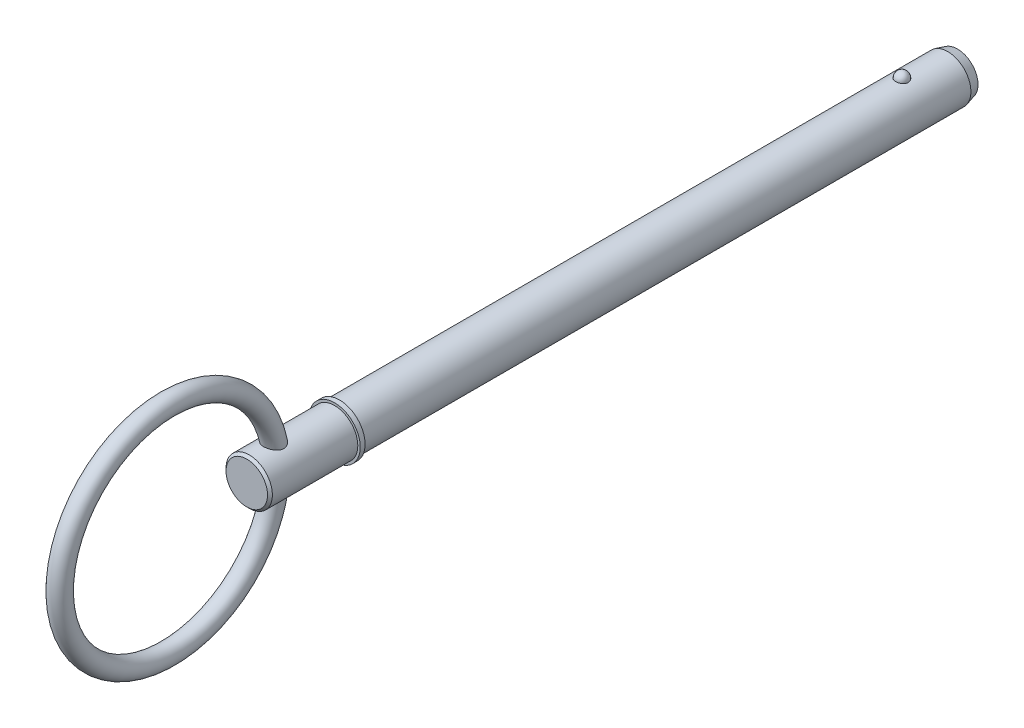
ISO-10303-21;
HEADER;
FILE_DESCRIPTION(('STEP AP214'),'2;1');
FILE_NAME('part.step','',(''),(''),'','','');
FILE_SCHEMA(('AUTOMOTIVE_DESIGN { 1 0 10303 214 1 1 1 1 }'));
ENDSEC;
DATA;
#1=APPLICATION_CONTEXT('core data for automotive mechanical design processes');
#2=APPLICATION_PROTOCOL_DEFINITION('international standard','automotive_design',2000,#1);
#3=PRODUCT_CONTEXT('',#1,'mechanical');
#4=PRODUCT('Part','Part','',(#3));
#5=PRODUCT_RELATED_PRODUCT_CATEGORY('part','',(#4));
#6=PRODUCT_DEFINITION_FORMATION('','',#4);
#7=PRODUCT_DEFINITION_CONTEXT('part definition',#1,'design');
#8=PRODUCT_DEFINITION('design','',#6,#7);
#9=PRODUCT_DEFINITION_SHAPE('','',#8);
#10=(LENGTH_UNIT() NAMED_UNIT(*) SI_UNIT(.MILLI.,.METRE.));
#11=(NAMED_UNIT(*) PLANE_ANGLE_UNIT() SI_UNIT($,.RADIAN.));
#12=(NAMED_UNIT(*) SI_UNIT($,.STERADIAN.) SOLID_ANGLE_UNIT());
#13=UNCERTAINTY_MEASURE_WITH_UNIT(LENGTH_MEASURE(1.E-05),#10,'distance_accuracy_value','');
#14=(GEOMETRIC_REPRESENTATION_CONTEXT(3) GLOBAL_UNCERTAINTY_ASSIGNED_CONTEXT((#13)) GLOBAL_UNIT_ASSIGNED_CONTEXT((#10,
#11,#12)) REPRESENTATION_CONTEXT('',''));
#15=CARTESIAN_POINT('',(0.,0.,0.));
#16=DIRECTION('',(0.,0.,1.));
#17=DIRECTION('',(1.,0.,0.));
#18=AXIS2_PLACEMENT_3D('',#15,#16,#17);
#19=CARTESIAN_POINT('',(0.,0.,114.3));
#20=DIRECTION('',(0.,0.,-1.));
#21=DIRECTION('',(-1.,0.,0.));
#22=AXIS2_PLACEMENT_3D('',#19,#20,#21);
#23=CYLINDRICAL_SURFACE('',#22,4.765);
#24=CARTESIAN_POINT('',(1.27812710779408,4.59038300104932,-1.29000000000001));
#25=CARTESIAN_POINT('',(1.27812572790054,4.59038414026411,-1.2178688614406));
#26=CARTESIAN_POINT('',(1.27223018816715,4.59203736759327,-1.14572000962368));
#27=CARTESIAN_POINT('',(1.24878929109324,4.59846646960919,-1.00346315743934));
#28=CARTESIAN_POINT('',(1.23123896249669,4.60324367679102,-0.933356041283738));
#29=CARTESIAN_POINT('',(1.18493861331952,4.61537801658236,-0.797215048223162));
#30=CARTESIAN_POINT('',(1.15619354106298,4.62273400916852,-0.731179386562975));
#31=CARTESIAN_POINT('',(1.08822596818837,4.6392032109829,-0.604986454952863));
#32=CARTESIAN_POINT('',(1.04900384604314,4.64831635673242,-0.54482897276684));
#33=CARTESIAN_POINT('',(0.960865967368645,4.66733302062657,-0.43177548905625));
#34=CARTESIAN_POINT('',(0.911906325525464,4.67723999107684,-0.378914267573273));
#35=CARTESIAN_POINT('',(0.805678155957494,4.69670280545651,-0.282245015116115));
#36=CARTESIAN_POINT('',(0.748409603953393,4.70625864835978,-0.238437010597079));
#37=CARTESIAN_POINT('',(0.627266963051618,4.72392767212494,-0.161207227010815));
#38=CARTESIAN_POINT('',(0.563411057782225,4.73204466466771,-0.127757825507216));
#39=CARTESIAN_POINT('',(0.430755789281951,4.74595788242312,-0.0720471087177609));
#40=CARTESIAN_POINT('',(0.361956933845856,4.75175434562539,-0.0497846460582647));
#41=CARTESIAN_POINT('',(0.222605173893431,4.76030056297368,-0.0173750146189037));
#42=CARTESIAN_POINT('',(0.152101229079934,4.76309991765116,-0.00703038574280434));
#43=CARTESIAN_POINT('',(0.0103009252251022,4.76551622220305,0.00191361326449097));
#44=CARTESIAN_POINT('',(-0.060995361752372,4.76513345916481,0.000514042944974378));
#45=CARTESIAN_POINT('',(-0.201348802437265,4.76125496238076,-0.0138891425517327));
#46=CARTESIAN_POINT('',(-0.270423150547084,4.75780093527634,-0.026737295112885));
#47=CARTESIAN_POINT('',(-0.405377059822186,4.74820737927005,-0.0634598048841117));
#48=CARTESIAN_POINT('',(-0.4712565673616,4.74206780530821,-0.087334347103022));
#49=CARTESIAN_POINT('',(-0.598375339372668,4.72771507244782,-0.145611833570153));
#50=CARTESIAN_POINT('',(-0.659587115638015,4.71949070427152,-0.180071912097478));
#51=CARTESIAN_POINT('',(-0.775356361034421,4.70185936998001,-0.258542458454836));
#52=CARTESIAN_POINT('',(-0.829913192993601,4.69245229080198,-0.302553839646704));
#53=CARTESIAN_POINT('',(-0.931895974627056,4.67327936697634,-0.399829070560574));
#54=CARTESIAN_POINT('',(-0.979176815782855,4.66351011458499,-0.453244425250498));
#55=CARTESIAN_POINT('',(-1.06421220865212,4.64484426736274,-0.567321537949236));
#56=CARTESIAN_POINT('',(-1.10196613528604,4.63594772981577,-0.627983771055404));
#57=CARTESIAN_POINT('',(-1.16735225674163,4.61992036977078,-0.755585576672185));
#58=CARTESIAN_POINT('',(-1.19487251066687,4.61280933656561,-0.822585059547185));
#59=CARTESIAN_POINT('',(-1.23851975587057,4.60128324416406,-0.960417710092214));
#60=CARTESIAN_POINT('',(-1.25464705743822,4.59686811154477,-1.03125077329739));
#61=CARTESIAN_POINT('',(-1.27505790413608,4.59124882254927,-1.17443804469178));
#62=CARTESIAN_POINT('',(-1.27938868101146,4.59003186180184,-1.24678501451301));
#63=CARTESIAN_POINT('',(-1.27623192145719,4.5909105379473,-1.3911989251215));
#64=CARTESIAN_POINT('',(-1.26874468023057,4.59300609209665,-1.46326587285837));
#65=CARTESIAN_POINT('',(-1.24220427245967,4.60025423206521,-1.60473192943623));
#66=CARTESIAN_POINT('',(-1.2232043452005,4.60539274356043,-1.67414176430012));
#67=CARTESIAN_POINT('',(-1.1741591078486,4.61813957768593,-1.80870154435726));
#68=CARTESIAN_POINT('',(-1.1441133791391,4.62574799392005,-1.87385132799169));
#69=CARTESIAN_POINT('',(-1.07354327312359,4.64263368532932,-1.99841604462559));
#70=CARTESIAN_POINT('',(-1.03296580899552,4.65191934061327,-2.0577997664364));
#71=CARTESIAN_POINT('',(-0.942433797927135,4.67110036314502,-2.16881966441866));
#72=CARTESIAN_POINT('',(-0.892478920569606,4.68099575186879,-2.22045556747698));
#73=CARTESIAN_POINT('',(-0.784302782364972,4.70033161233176,-2.31471696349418));
#74=CARTESIAN_POINT('',(-0.726054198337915,4.70977043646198,-2.35731146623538));
#75=CARTESIAN_POINT('',(-0.602997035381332,4.72709995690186,-2.43206620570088));
#76=CARTESIAN_POINT('',(-0.538188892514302,4.73499075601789,-2.46422713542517));
#77=CARTESIAN_POINT('',(-0.404639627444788,4.7482563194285,-2.51687454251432));
#78=CARTESIAN_POINT('',(-0.33595386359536,4.7536596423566,-2.53749415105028));
#79=CARTESIAN_POINT('',(-0.195948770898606,4.76148510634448,-2.56703727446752));
#80=CARTESIAN_POINT('',(-0.124629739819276,4.76390758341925,-2.57596210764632));
#81=CARTESIAN_POINT('',(0.017269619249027,4.76548774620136,-2.58180339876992));
#82=CARTESIAN_POINT('',(0.0878407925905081,4.76470225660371,-2.57892886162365));
#83=CARTESIAN_POINT('',(0.227467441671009,4.76008019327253,-2.56172603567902));
#84=CARTESIAN_POINT('',(0.296522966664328,4.75624371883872,-2.54739811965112));
#85=CARTESIAN_POINT('',(0.430942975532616,4.74595041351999,-2.50776251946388));
#86=CARTESIAN_POINT('',(0.496319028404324,4.7395023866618,-2.48249170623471));
#87=CARTESIAN_POINT('',(0.621860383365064,4.72467083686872,-2.42167301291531));
#88=CARTESIAN_POINT('',(0.682025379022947,4.71628720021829,-2.38612452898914));
#89=CARTESIAN_POINT('',(0.796409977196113,4.69833598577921,-2.30511163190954));
#90=CARTESIAN_POINT('',(0.850529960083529,4.68875291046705,-2.25951003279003));
#91=CARTESIAN_POINT('',(0.95041297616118,4.66953243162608,-2.15992428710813));
#92=CARTESIAN_POINT('',(0.996174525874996,4.65989501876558,-2.10593865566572));
#93=CARTESIAN_POINT('',(1.07885962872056,4.64145616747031,-1.99009376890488));
#94=CARTESIAN_POINT('',(1.11562789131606,4.63267081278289,-1.92812106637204));
#95=CARTESIAN_POINT('',(1.17840570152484,4.61710269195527,-1.79873681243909));
#96=CARTESIAN_POINT('',(1.20441973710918,4.61031909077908,-1.73132754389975));
#97=CARTESIAN_POINT('',(1.24242116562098,4.60021170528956,-1.60192906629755));
#98=CARTESIAN_POINT('',(1.25578772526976,4.59655387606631,-1.54036674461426));
#99=CARTESIAN_POINT('',(1.27364121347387,4.59163904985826,-1.41587409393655));
#100=CARTESIAN_POINT('',(1.2781283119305,4.59038200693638,-1.35294379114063));
#101=CARTESIAN_POINT('',(1.27812710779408,4.59038300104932,-1.29000000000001));
#102=B_SPLINE_CURVE_WITH_KNOTS('',3,(#24,#25,#26,#27,#28,#29,#30,#31,#32,#33,#34,#35,#36,#37,
#38,#39,#40,#41,#42,#43,#44,#45,#46,#47,#48,#49,#50,#51,#52,#53,#54,#55,#56,#57,#58,#59,#60,#61,
#62,#63,#64,#65,#66,#67,#68,#69,#70,#71,#72,#73,#74,#75,#76,#77,#78,#79,#80,#81,#82,#83,#84,#85,
#86,#87,#88,#89,#90,#91,#92,#93,#94,#95,#96,#97,#98,#99,#100,#101),.UNSPECIFIED.,.T.,.F.,(4,2,2,
2,2,2,2,2,2,2,2,2,2,2,2,2,2,2,2,2,2,2,2,2,2,2,2,2,2,2,2,2,2,2,2,2,2,2,4),(0.,0.216167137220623,
0.432426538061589,0.648590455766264,0.864746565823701,1.0818998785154,1.29905382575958,
1.51562361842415,1.73217119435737,1.94507683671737,2.15796327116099,2.36800220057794,
2.57804465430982,2.78924132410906,3.00045819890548,3.21545551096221,3.43046692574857,
3.64776550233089,3.86505816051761,4.08147951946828,4.29789547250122,4.51331818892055,
4.72874907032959,4.94528769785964,5.1618339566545,5.37911087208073,5.59637335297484,
5.8110751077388,6.02575265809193,6.23664413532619,6.44752874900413,6.65770827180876,
6.86790014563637,7.08116060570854,7.29445887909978,7.51121476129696,7.72788009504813,
7.91651762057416,8.10515153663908),.UNSPECIFIED.);
#103=CARTESIAN_POINT('',(1.27812710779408,4.59038300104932,-1.29000000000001));
#104=VERTEX_POINT('',#103);
#105=EDGE_CURVE('E102',#104,#104,#102,.T.);
#106=ORIENTED_EDGE('',*,*,#105,.T.);
#107=EDGE_LOOP('',(#106));
#108=FACE_BOUND('',#107,.T.);
#109=CARTESIAN_POINT('',(0.,0.,-10.7));
#110=DIRECTION('',(0.,0.,-1.));
#111=DIRECTION('',(-1.,0.,0.));
#112=AXIS2_PLACEMENT_3D('',#109,#110,#111);
#113=CIRCLE('',#112,4.765);
#114=CARTESIAN_POINT('',(-4.765,0.,-10.7));
#115=VERTEX_POINT('',#114);
#116=EDGE_CURVE('E110',#115,#115,#113,.F.);
#117=ORIENTED_EDGE('',*,*,#116,.T.);
#118=EDGE_LOOP('',(#117));
#119=FACE_BOUND('',#118,.T.);
#120=CARTESIAN_POINT('',(0.,0.,114.3));
#121=DIRECTION('',(0.,0.,1.));
#122=DIRECTION('',(1.,0.,0.));
#123=AXIS2_PLACEMENT_3D('',#120,#121,#122);
#124=CIRCLE('',#123,4.765);
#125=CARTESIAN_POINT('',(4.765,0.,114.3));
#126=VERTEX_POINT('',#125);
#127=EDGE_CURVE('E108',#126,#126,#124,.T.);
#128=ORIENTED_EDGE('',*,*,#127,.F.);
#129=EDGE_LOOP('',(#128));
#130=FACE_BOUND('',#129,.T.);
#131=ADVANCED_FACE('F39',(#108,#119,#130),#23,.T.);
#132=CARTESIAN_POINT('',(0.,0.,-12.7));
#133=DIRECTION('',(0.,0.,-1.));
#134=DIRECTION('',(-1.,0.,0.));
#135=AXIS2_PLACEMENT_3D('',#132,#133,#134);
#136=PLANE('',#135);
#137=CARTESIAN_POINT('',(0.,0.,-12.7));
#138=DIRECTION('',(0.,0.,-1.));
#139=DIRECTION('',(-1.,0.,0.));
#140=AXIS2_PLACEMENT_3D('',#137,#138,#139);
#141=CIRCLE('',#140,4.22910161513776);
#142=CARTESIAN_POINT('',(-4.22910161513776,0.,-12.7));
#143=VERTEX_POINT('',#142);
#144=EDGE_CURVE('E141',#143,#143,#141,.T.);
#145=ORIENTED_EDGE('',*,*,#144,.T.);
#146=EDGE_LOOP('',(#145));
#147=FACE_BOUND('',#146,.T.);
#148=ADVANCED_FACE('F88',(#147),#136,.T.);
#149=CARTESIAN_POINT('',(0.,0.,-12.7));
#150=DIRECTION('',(0.,0.,1.));
#151=DIRECTION('',(1.,0.,0.));
#152=AXIS2_PLACEMENT_3D('',#149,#150,#151);
#153=CONICAL_SURFACE('',#152,4.22910161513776,0.261799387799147);
#154=ORIENTED_EDGE('',*,*,#116,.F.);
#155=EDGE_LOOP('',(#154));
#156=FACE_BOUND('',#155,.T.);
#157=ORIENTED_EDGE('',*,*,#144,.F.);
#158=EDGE_LOOP('',(#157));
#159=FACE_BOUND('',#158,.T.);
#160=ADVANCED_FACE('F94',(#156,#159),#153,.T.);
#161=CARTESIAN_POINT('',(0.,4.765,-1.29000000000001));
#162=DIRECTION('',(0.,1.,0.));
#163=DIRECTION('',(0.,0.,-1.));
#164=AXIS2_PLACEMENT_3D('',#161,#162,#163);
#165=SPHERICAL_SURFACE('',#164,1.29);
#166=ORIENTED_EDGE('',*,*,#105,.F.);
#167=EDGE_LOOP('',(#166));
#168=FACE_BOUND('',#167,.T.);
#169=ADVANCED_FACE('F113',(#168),#165,.T.);
#170=CARTESIAN_POINT('',(0.,0.,114.3));
#171=DIRECTION('',(0.,0.,-1.));
#172=DIRECTION('',(-1.,0.,0.));
#173=AXIS2_PLACEMENT_3D('',#170,#171,#172);
#174=PLANE('',#173);
#175=ORIENTED_EDGE('',*,*,#127,.T.);
#176=EDGE_LOOP('',(#175));
#177=FACE_BOUND('',#176,.T.);
#178=CARTESIAN_POINT('',(0.,0.,114.3));
#179=DIRECTION('',(0.,0.,-1.));
#180=DIRECTION('',(-1.,0.,0.));
#181=AXIS2_PLACEMENT_3D('',#178,#179,#180);
#182=CIRCLE('',#181,5.265);
#183=CARTESIAN_POINT('',(-5.265,0.,114.3));
#184=VERTEX_POINT('',#183);
#185=EDGE_CURVE('E109',#184,#184,#182,.T.);
#186=ORIENTED_EDGE('',*,*,#185,.T.);
#187=EDGE_LOOP('',(#186));
#188=FACE_BOUND('',#187,.T.);
#189=ADVANCED_FACE('F117',(#177,#188),#174,.T.);
#190=CARTESIAN_POINT('',(0.,0.,33.7287874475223));
#191=DIRECTION('',(0.,0.,-1.));
#192=DIRECTION('',(-1.,0.,0.));
#193=AXIS2_PLACEMENT_3D('',#190,#191,#192);
#194=CYLINDRICAL_SURFACE('',#193,5.265);
#195=CARTESIAN_POINT('',(0.,0.,115.3));
#196=DIRECTION('',(0.,0.,-1.));
#197=DIRECTION('',(-1.,0.,0.));
#198=AXIS2_PLACEMENT_3D('',#195,#196,#197);
#199=CIRCLE('',#198,5.265);
#200=CARTESIAN_POINT('',(-5.265,0.,115.3));
#201=VERTEX_POINT('',#200);
#202=EDGE_CURVE('E134',#201,#201,#199,.T.);
#203=ORIENTED_EDGE('',*,*,#202,.T.);
#204=EDGE_LOOP('',(#203));
#205=FACE_BOUND('',#204,.T.);
#206=ORIENTED_EDGE('',*,*,#185,.F.);
#207=EDGE_LOOP('',(#206));
#208=FACE_BOUND('',#207,.T.);
#209=ADVANCED_FACE('F121',(#205,#208),#194,.T.);
#210=CARTESIAN_POINT('',(0.,5.265,115.3));
#211=DIRECTION('',(0.,0.,1.));
#212=DIRECTION('',(1.,0.,0.));
#213=AXIS2_PLACEMENT_3D('',#210,#211,#212);
#214=PLANE('',#213);
#215=CARTESIAN_POINT('',(0.,0.,115.3));
#216=DIRECTION('',(0.,0.,1.));
#217=DIRECTION('',(1.,0.,0.));
#218=AXIS2_PLACEMENT_3D('',#215,#216,#217);
#219=CIRCLE('',#218,4.765);
#220=CARTESIAN_POINT('',(4.765,0.,115.3));
#221=VERTEX_POINT('',#220);
#222=EDGE_CURVE('E112',#221,#221,#219,.T.);
#223=ORIENTED_EDGE('',*,*,#222,.F.);
#224=EDGE_LOOP('',(#223));
#225=FACE_BOUND('',#224,.T.);
#226=ORIENTED_EDGE('',*,*,#202,.F.);
#227=EDGE_LOOP('',(#226));
#228=FACE_BOUND('',#227,.T.);
#229=ADVANCED_FACE('F85',(#225,#228),#214,.T.);
#230=CARTESIAN_POINT('',(0.,0.,133.35));
#231=DIRECTION('',(0.,0.,-1.));
#232=DIRECTION('',(-1.,0.,0.));
#233=AXIS2_PLACEMENT_3D('',#230,#231,#232);
#234=CYLINDRICAL_SURFACE('',#233,4.765);
#235=CARTESIAN_POINT('',(-1.1760358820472,-4.61759294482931,126.18372006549));
#236=CARTESIAN_POINT('',(-1.08605054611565,-4.64050753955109,126.1215688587));
#237=CARTESIAN_POINT('',(-0.990486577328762,-4.66202408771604,126.06673933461));
#238=CARTESIAN_POINT('',(-0.790762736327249,-4.70002969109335,125.972995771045));
#239=CARTESIAN_POINT('',(-0.686587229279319,-4.7165093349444,125.934111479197));
#240=CARTESIAN_POINT('',(-0.472539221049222,-4.74273618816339,125.873267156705));
#241=CARTESIAN_POINT('',(-0.362665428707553,-4.75248186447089,125.851310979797));
#242=CARTESIAN_POINT('',(-0.140482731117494,-4.7642267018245,125.824936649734));
#243=CARTESIAN_POINT('',(-0.0281752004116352,-4.7662301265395,125.820508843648));
#244=CARTESIAN_POINT('',(0.193745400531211,-4.76233166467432,125.829208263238));
#245=CARTESIAN_POINT('',(0.303372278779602,-4.75656024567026,125.842045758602));
#246=CARTESIAN_POINT('',(0.518724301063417,-4.73791484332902,125.884434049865));
#247=CARTESIAN_POINT('',(0.624448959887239,-4.72503997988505,125.913986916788));
#248=CARTESIAN_POINT('',(0.829434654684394,-4.69340588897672,125.98920858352));
#249=CARTESIAN_POINT('',(0.928674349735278,-4.67462830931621,126.034927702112));
#250=CARTESIAN_POINT('',(1.11777413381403,-4.63305392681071,126.141473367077));
#251=CARTESIAN_POINT('',(1.2076321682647,-4.61025624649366,126.202303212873));
#252=CARTESIAN_POINT('',(1.37762760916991,-4.56238439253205,126.339439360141));
#253=CARTESIAN_POINT('',(1.45749020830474,-4.53726959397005,126.41607281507));
#254=CARTESIAN_POINT('',(1.60275140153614,-4.48801828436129,126.582293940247));
#255=CARTESIAN_POINT('',(1.66815155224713,-4.46388166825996,126.671880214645));
#256=CARTESIAN_POINT('',(1.78162069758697,-4.41980966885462,126.860468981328));
#257=CARTESIAN_POINT('',(1.82993675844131,-4.39981628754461,126.959308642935));
#258=CARTESIAN_POINT('',(1.90902953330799,-4.36608532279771,127.164739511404));
#259=CARTESIAN_POINT('',(1.93981696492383,-4.35234391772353,127.271325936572));
#260=CARTESIAN_POINT('',(1.98181129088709,-4.33337618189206,127.482380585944));
#261=CARTESIAN_POINT('',(1.99406945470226,-4.32769391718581,127.58660066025));
#262=CARTESIAN_POINT('',(2.0025484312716,-4.32377679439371,127.795812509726));
#263=CARTESIAN_POINT('',(1.99876733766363,-4.32554282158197,127.900804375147));
#264=CARTESIAN_POINT('',(1.97595504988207,-4.33600911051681,128.109105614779));
#265=CARTESIAN_POINT('',(1.95686739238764,-4.34473504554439,128.212407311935));
#266=CARTESIAN_POINT('',(1.90457346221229,-4.36790947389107,128.414679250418));
#267=CARTESIAN_POINT('',(1.87136191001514,-4.38236010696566,128.513647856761));
#268=CARTESIAN_POINT('',(1.78747856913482,-4.41728816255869,128.716470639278));
#269=CARTESIAN_POINT('',(1.73524632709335,-4.43826528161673,128.819592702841));
#270=CARTESIAN_POINT('',(1.6160725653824,-4.48303292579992,129.016386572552));
#271=CARTESIAN_POINT('',(1.54911576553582,-4.50682636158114,129.110048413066));
#272=CARTESIAN_POINT('',(1.39359064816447,-4.55746895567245,129.295383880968));
#273=CARTESIAN_POINT('',(1.30346928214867,-4.58437060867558,129.385750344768));
#274=CARTESIAN_POINT('',(1.10794390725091,-4.6354985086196,129.549011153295));
#275=CARTESIAN_POINT('',(1.00255934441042,-4.65972809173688,129.621927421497));
#276=CARTESIAN_POINT('',(0.803761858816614,-4.69755503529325,129.732407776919));
#277=CARTESIAN_POINT('',(0.712935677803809,-4.71231838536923,129.774230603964));
#278=CARTESIAN_POINT('',(0.525172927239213,-4.73691370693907,129.842936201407));
#279=CARTESIAN_POINT('',(0.42824208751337,-4.74675022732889,129.869832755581));
#280=CARTESIAN_POINT('',(0.230351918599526,-4.76046566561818,129.907147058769));
#281=CARTESIAN_POINT('',(0.129376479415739,-4.76431768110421,129.917490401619));
#282=CARTESIAN_POINT('',(-0.0728965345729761,-4.76551495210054,129.920716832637));
#283=CARTESIAN_POINT('',(-0.174194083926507,-4.76286070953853,129.91360126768));
#284=CARTESIAN_POINT('',(-0.36646785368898,-4.75179292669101,129.883579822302));
#285=CARTESIAN_POINT('',(-0.457659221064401,-4.74381187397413,129.861858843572));
#286=CARTESIAN_POINT('',(-0.635226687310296,-4.72331548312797,129.805084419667));
#287=CARTESIAN_POINT('',(-0.721601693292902,-4.71079912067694,129.770027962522));
#288=CARTESIAN_POINT('',(-0.893212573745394,-4.68139468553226,129.685559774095));
#289=CARTESIAN_POINT('',(-0.97802747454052,-4.66427939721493,129.635377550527));
#290=CARTESIAN_POINT('',(-1.13917803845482,-4.62756330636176,129.523642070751));
#291=CARTESIAN_POINT('',(-1.21550961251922,-4.60796131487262,129.462083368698));
#292=CARTESIAN_POINT('',(-1.37033540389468,-4.56452178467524,129.31868852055));
#293=CARTESIAN_POINT('',(-1.44723650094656,-4.54050700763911,129.235184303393));
#294=CARTESIAN_POINT('',(-1.58763850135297,-4.49334232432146,129.057292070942));
#295=CARTESIAN_POINT('',(-1.65112672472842,-4.47019325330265,128.962893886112));
#296=CARTESIAN_POINT('',(-1.77033243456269,-4.42444393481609,128.753206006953));
#297=CARTESIAN_POINT('',(-1.82420433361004,-4.40224259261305,128.636768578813));
#298=CARTESIAN_POINT('',(-1.91169086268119,-4.36496831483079,128.395409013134));
#299=CARTESIAN_POINT('',(-1.94531523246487,-4.3498919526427,128.270490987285));
#300=CARTESIAN_POINT('',(-1.98892523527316,-4.33012255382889,128.022016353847));
#301=CARTESIAN_POINT('',(-1.99998275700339,-4.32495941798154,127.898689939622));
#302=CARTESIAN_POINT('',(-2.00001713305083,-4.32494814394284,127.652073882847));
#303=CARTESIAN_POINT('',(-1.98902141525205,-4.33008719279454,127.528784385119));
#304=CARTESIAN_POINT('',(-1.94752572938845,-4.34888267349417,127.30321378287));
#305=CARTESIAN_POINT('',(-1.91979754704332,-4.3613227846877,127.200310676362));
#306=CARTESIAN_POINT('',(-1.84805595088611,-4.39220107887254,127.001251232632));
#307=CARTESIAN_POINT('',(-1.80403476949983,-4.41064212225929,126.905098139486));
#308=CARTESIAN_POINT('',(-1.70232000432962,-4.45086896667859,126.724457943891));
#309=CARTESIAN_POINT('',(-1.64499853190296,-4.47255887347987,126.639738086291));
#310=CARTESIAN_POINT('',(-1.51770958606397,-4.51733419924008,126.481012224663));
#311=CARTESIAN_POINT('',(-1.44776268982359,-4.54041730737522,126.406989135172));
#312=CARTESIAN_POINT('',(-1.34143544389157,-4.57239833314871,126.31104340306));
#313=CARTESIAN_POINT('',(-1.3095525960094,-4.58164274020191,126.284115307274));
#314=CARTESIAN_POINT('',(-1.24406394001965,-4.59985727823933,126.232340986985));
#315=CARTESIAN_POINT('',(-1.21045807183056,-4.6088273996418,126.20749483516));
#316=CARTESIAN_POINT('',(-1.1760358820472,-4.61759294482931,126.18372006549));
#317=B_SPLINE_CURVE_WITH_KNOTS('',3,(#235,#236,#237,#238,#239,#240,#241,#242,#243,#244,#245,
#246,#247,#248,#249,#250,#251,#252,#253,#254,#255,#256,#257,#258,#259,#260,#261,#262,#263,#264,
#265,#266,#267,#268,#269,#270,#271,#272,#273,#274,#275,#276,#277,#278,#279,#280,#281,#282,#283,
#284,#285,#286,#287,#288,#289,#290,#291,#292,#293,#294,#295,#296,#297,#298,#299,#300,#301,#302,
#303,#304,#305,#306,#307,#308,#309,#310,#311,#312,#313,#314,#315,#316),.UNSPECIFIED.,.T.,.F.,(4,
2,2,2,2,2,2,2,2,2,2,2,2,2,2,2,2,2,2,2,2,2,2,2,2,2,2,2,2,2,2,2,2,2,2,2,2,2,2,2,4),(0.,
0.335054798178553,0.670731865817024,1.00648532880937,1.34205386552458,1.67206089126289,
2.00210881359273,2.33319321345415,2.66434996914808,3.00321157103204,3.34203668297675,
3.6757394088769,4.00923787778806,4.32299322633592,4.63678586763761,4.95174139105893,
5.26681474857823,5.61785759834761,5.96926647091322,6.35862694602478,6.747495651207,
7.04947204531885,7.35116911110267,7.65421852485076,7.95724456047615,8.23825252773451,
8.51932400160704,8.81825171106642,9.1173228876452,9.46404422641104,9.81109188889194,
10.1997682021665,10.5882573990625,10.9578189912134,11.32692124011,11.6472091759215,
11.9676500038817,12.2800235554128,12.5918925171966,12.7200569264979,12.8482258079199),.UNSPECIFIED.);
#318=CARTESIAN_POINT('',(-1.1760358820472,-4.61759294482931,126.18372006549));
#319=VERTEX_POINT('',#318);
#320=EDGE_CURVE('E10',#319,#319,#317,.T.);
#321=ORIENTED_EDGE('',*,*,#320,.F.);
#322=EDGE_LOOP('',(#321));
#323=FACE_BOUND('',#322,.T.);
#324=CARTESIAN_POINT('',(-1.1760358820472,4.61759294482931,126.18372006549));
#325=CARTESIAN_POINT('',(-1.26499234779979,4.59493450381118,126.245169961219));
#326=CARTESIAN_POINT('',(-1.34870034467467,4.5708599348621,126.313915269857));
#327=CARTESIAN_POINT('',(-1.50334626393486,4.52236448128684,126.464635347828));
#328=CARTESIAN_POINT('',(-1.57425996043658,4.49794303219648,126.546634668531));
#329=CARTESIAN_POINT('',(-1.70130187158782,4.45144771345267,126.722234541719));
#330=CARTESIAN_POINT('',(-1.75740699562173,4.42937754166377,126.81585288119));
#331=CARTESIAN_POINT('',(-1.85287755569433,4.39030189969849,127.012166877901));
#332=CARTESIAN_POINT('',(-1.8922587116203,4.37329167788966,127.114853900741));
#333=CARTESIAN_POINT('',(-1.95188661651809,4.34699775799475,127.321857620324));
#334=CARTESIAN_POINT('',(-1.97286468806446,4.33742068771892,127.425926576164));
#335=CARTESIAN_POINT('',(-1.99814509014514,4.32583397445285,127.636471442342));
#336=CARTESIAN_POINT('',(-2.00244696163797,4.32382453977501,127.742947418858));
#337=CARTESIAN_POINT('',(-1.99499900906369,4.32726361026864,127.952770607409));
#338=CARTESIAN_POINT('',(-1.9836061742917,4.33254625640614,128.056134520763));
#339=CARTESIAN_POINT('',(-1.9464361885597,4.34936983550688,128.259691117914));
#340=CARTESIAN_POINT('',(-1.92065444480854,4.36091276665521,128.359882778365));
#341=CARTESIAN_POINT('',(-1.85292379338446,4.39014527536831,128.56410420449));
#342=CARTESIAN_POINT('',(-1.80971134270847,4.40830066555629,128.667646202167));
#343=CARTESIAN_POINT('',(-1.70892742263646,4.44833985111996,128.866768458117));
#344=CARTESIAN_POINT('',(-1.65134284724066,4.47022704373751,128.962341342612));
#345=CARTESIAN_POINT('',(-1.51475300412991,4.51847764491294,129.155260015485));
#346=CARTESIAN_POINT('',(-1.4339566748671,4.54505660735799,129.251291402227));
#347=CARTESIAN_POINT('',(-1.25684082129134,4.59718102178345,129.428132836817));
#348=CARTESIAN_POINT('',(-1.16053129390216,4.6227271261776,129.508952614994));
#349=CARTESIAN_POINT('',(-0.972192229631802,4.66558476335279,129.639326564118));
#350=CARTESIAN_POINT('',(-0.882391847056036,4.68355428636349,129.691879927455));
#351=CARTESIAN_POINT('',(-0.694836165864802,4.71502283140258,129.782022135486));
#352=CARTESIAN_POINT('',(-0.597087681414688,4.72852563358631,129.819623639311));
#353=CARTESIAN_POINT('',(-0.395321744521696,4.74966109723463,129.877875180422));
#354=CARTESIAN_POINT('',(-0.291269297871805,4.7572569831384,129.898419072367));
#355=CARTESIAN_POINT('',(-0.0808979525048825,4.76547327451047,129.920624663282));
#356=CARTESIAN_POINT('',(0.0254198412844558,4.76609700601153,129.92229536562));
#357=CARTESIAN_POINT('',(0.225327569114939,4.7606097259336,129.907485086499));
#358=CARTESIAN_POINT('',(0.319084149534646,4.75519734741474,129.892887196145));
#359=CARTESIAN_POINT('',(0.502750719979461,4.73930039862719,129.849397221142));
#360=CARTESIAN_POINT('',(0.592660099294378,4.7288150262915,129.820502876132));
#361=CARTESIAN_POINT('',(0.768777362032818,4.70343779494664,129.74904136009));
#362=CARTESIAN_POINT('',(0.854839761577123,4.68844387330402,129.706155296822));
#363=CARTESIAN_POINT('',(1.01943666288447,4.65543047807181,129.608746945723));
#364=CARTESIAN_POINT('',(1.09796821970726,4.63740982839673,129.554220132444));
#365=CARTESIAN_POINT('',(1.25751825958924,4.59691257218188,129.426465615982));
#366=CARTESIAN_POINT('',(1.3372110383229,4.57417011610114,129.351667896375));
#367=CARTESIAN_POINT('',(1.48461190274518,4.52847869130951,129.191082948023));
#368=CARTESIAN_POINT('',(1.55230949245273,4.50552956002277,129.105286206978));
#369=CARTESIAN_POINT('',(1.68366050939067,4.45825797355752,128.911404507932));
#370=CARTESIAN_POINT('',(1.74532014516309,4.43421533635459,128.801889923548));
#371=CARTESIAN_POINT('',(1.85007805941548,4.39154308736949,128.573269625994));
#372=CARTESIAN_POINT('',(1.89317429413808,4.37291407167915,128.454162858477));
#373=CARTESIAN_POINT('',(1.958572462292,4.34402041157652,128.209763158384));
#374=CARTESIAN_POINT('',(1.98095022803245,4.33372528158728,128.084494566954));
#375=CARTESIAN_POINT('',(2.00301292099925,4.32358016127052,127.831594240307));
#376=CARTESIAN_POINT('',(2.00273000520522,4.32371536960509,127.703966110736));
#377=CARTESIAN_POINT('',(1.97997568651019,4.3341693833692,127.468247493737));
#378=CARTESIAN_POINT('',(1.96044562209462,4.34313814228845,127.359806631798));
#379=CARTESIAN_POINT('',(1.90368145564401,4.36831534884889,127.148543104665));
#380=CARTESIAN_POINT('',(1.86644884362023,4.38452318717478,127.045719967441));
#381=CARTESIAN_POINT('',(1.77811542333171,4.42104679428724,126.85471002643));
#382=CARTESIAN_POINT('',(1.72797707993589,4.44105894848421,126.766015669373));
#383=CARTESIAN_POINT('',(1.61439500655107,4.48359504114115,126.598286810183));
#384=CARTESIAN_POINT('',(1.55094927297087,4.50611935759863,126.519253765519));
#385=CARTESIAN_POINT('',(1.40889349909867,4.55259151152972,126.368705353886));
#386=CARTESIAN_POINT('',(1.32968750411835,4.57655455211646,126.297757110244));
#387=CARTESIAN_POINT('',(1.16035884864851,4.62238936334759,126.169506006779));
#388=CARTESIAN_POINT('',(1.07023361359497,4.64426063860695,126.11220637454));
#389=CARTESIAN_POINT('',(0.877362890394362,4.68460759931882,126.010316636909));
#390=CARTESIAN_POINT('',(0.77424981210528,4.70290564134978,125.966349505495));
#391=CARTESIAN_POINT('',(0.561430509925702,4.73302876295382,125.895484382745));
#392=CARTESIAN_POINT('',(0.45172542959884,4.74485496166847,125.868583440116));
#393=CARTESIAN_POINT('',(0.230282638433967,4.76071009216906,125.832763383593));
#394=CARTESIAN_POINT('',(0.118587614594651,4.76483485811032,125.823623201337));
#395=CARTESIAN_POINT('',(-0.104911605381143,4.76515532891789,125.822908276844));
#396=CARTESIAN_POINT('',(-0.216715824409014,4.76134861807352,125.831338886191));
#397=CARTESIAN_POINT('',(-0.435231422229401,4.74632552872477,125.86524563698));
#398=CARTESIAN_POINT('',(-0.541996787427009,4.73523460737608,125.890433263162));
#399=CARTESIAN_POINT('',(-0.749371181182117,4.70686626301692,125.956921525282));
#400=CARTESIAN_POINT('',(-0.849990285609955,4.68959930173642,125.998194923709));
#401=CARTESIAN_POINT('',(-0.986108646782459,4.6620261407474,126.067235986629));
#402=CARTESIAN_POINT('',(-1.02525769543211,4.65355983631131,126.088772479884));
#403=CARTESIAN_POINT('',(-1.10191286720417,4.63600664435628,126.134367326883));
#404=CARTESIAN_POINT('',(-1.13941901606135,4.62691976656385,126.158425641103));
#405=CARTESIAN_POINT('',(-1.1760358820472,4.61759294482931,126.18372006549));
#406=B_SPLINE_CURVE_WITH_KNOTS('',3,(#324,#325,#326,#327,#328,#329,#330,#331,#332,#333,#334,
#335,#336,#337,#338,#339,#340,#341,#342,#343,#344,#345,#346,#347,#348,#349,#350,#351,#352,#353,
#354,#355,#356,#357,#358,#359,#360,#361,#362,#363,#364,#365,#366,#367,#368,#369,#370,#371,#372,
#373,#374,#375,#376,#377,#378,#379,#380,#381,#382,#383,#384,#385,#386,#387,#388,#389,#390,#391,
#392,#393,#394,#395,#396,#397,#398,#399,#400,#401,#402,#403,#404,#405),.UNSPECIFIED.,.T.,.F.,(4,
2,2,2,2,2,2,2,2,2,2,2,2,2,2,2,2,2,2,2,2,2,2,2,2,2,2,2,2,2,2,2,2,2,2,2,2,2,2,2,4),(0.,
0.331234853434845,0.663090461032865,0.995460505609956,1.32751743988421,1.64568783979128,
1.96386699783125,2.27492717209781,2.58608669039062,2.9257199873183,3.26566413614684,
3.6487519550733,4.03159388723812,4.34706664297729,4.66227172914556,4.97942386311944,
5.29642469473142,5.58021908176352,5.86405835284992,6.15488068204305,6.44581627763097,
6.77943874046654,7.11335170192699,7.49545660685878,7.87760356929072,8.25834622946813,
8.63854860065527,8.96843568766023,9.29829501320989,9.60842872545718,9.91860916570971,
10.2441707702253,10.5698092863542,10.9089029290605,11.2479379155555,11.5827251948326,
11.9176144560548,12.2468820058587,12.5755944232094,12.7119417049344,12.8482868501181),.UNSPECIFIED.);
#407=CARTESIAN_POINT('',(-1.1760358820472,4.61759294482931,126.18372006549));
#408=VERTEX_POINT('',#407);
#409=EDGE_CURVE('E51',#408,#408,#406,.T.);
#410=ORIENTED_EDGE('',*,*,#409,.F.);
#411=EDGE_LOOP('',(#410));
#412=FACE_BOUND('',#411,.T.);
#413=CARTESIAN_POINT('',(0.,0.,132.85));
#414=DIRECTION('',(0.,0.,-1.));
#415=DIRECTION('',(-1.,0.,0.));
#416=AXIS2_PLACEMENT_3D('',#413,#414,#415);
#417=CIRCLE('',#416,4.765);
#418=CARTESIAN_POINT('',(-4.765,0.,132.85));
#419=VERTEX_POINT('',#418);
#420=EDGE_CURVE('E64',#419,#419,#417,.T.);
#421=ORIENTED_EDGE('',*,*,#420,.T.);
#422=EDGE_LOOP('',(#421));
#423=FACE_BOUND('',#422,.T.);
#424=ORIENTED_EDGE('',*,*,#222,.T.);
#425=EDGE_LOOP('',(#424));
#426=FACE_BOUND('',#425,.T.);
#427=ADVANCED_FACE('F69',(#323,#412,#423,#426),#234,.T.);
#428=CARTESIAN_POINT('',(0.,0.,133.35));
#429=DIRECTION('',(0.,0.,-1.));
#430=DIRECTION('',(-1.,0.,0.));
#431=AXIS2_PLACEMENT_3D('',#428,#429,#430);
#432=PLANE('',#431);
#433=CARTESIAN_POINT('',(0.,0.,133.35));
#434=DIRECTION('',(0.,0.,-1.));
#435=DIRECTION('',(-1.,0.,0.));
#436=AXIS2_PLACEMENT_3D('',#433,#434,#435);
#437=CIRCLE('',#436,4.26499999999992);
#438=CARTESIAN_POINT('',(-4.26499999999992,0.,133.35));
#439=VERTEX_POINT('',#438);
#440=EDGE_CURVE('E57',#439,#439,#437,.F.);
#441=ORIENTED_EDGE('',*,*,#440,.T.);
#442=EDGE_LOOP('',(#441));
#443=FACE_BOUND('',#442,.T.);
#444=ADVANCED_FACE('F76',(#443),#432,.F.);
#445=CARTESIAN_POINT('',(0.,0.,132.85));
#446=DIRECTION('',(0.,0.,-1.));
#447=DIRECTION('',(-1.,0.,0.));
#448=AXIS2_PLACEMENT_3D('',#445,#446,#447);
#449=CONICAL_SURFACE('',#448,4.765,0.785398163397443);
#450=ORIENTED_EDGE('',*,*,#440,.F.);
#451=EDGE_LOOP('',(#450));
#452=FACE_BOUND('',#451,.T.);
#453=ORIENTED_EDGE('',*,*,#420,.F.);
#454=EDGE_LOOP('',(#453));
#455=FACE_BOUND('',#454,.T.);
#456=ADVANCED_FACE('F41',(#452,#455),#449,.T.);
#457=CARTESIAN_POINT('',(0.,0.,149.575));
#458=DIRECTION('',(1.,0.,0.));
#459=DIRECTION('',(0.,0.,-1.));
#460=AXIS2_PLACEMENT_3D('',#457,#458,#459);
#461=TOROIDAL_SURFACE('',#460,22.225,2.);
#462=ORIENTED_EDGE('',*,*,#320,.T.);
#463=EDGE_LOOP('',(#462));
#464=FACE_BOUND('',#463,.T.);
#465=ORIENTED_EDGE('',*,*,#409,.T.);
#466=EDGE_LOOP('',(#465));
#467=FACE_BOUND('',#466,.T.);
#468=ADVANCED_FACE('F73',(#464,#467),#461,.T.);
#469=CLOSED_SHELL('',(#131,#148,#160,#169,#189,#209,#229,#427,#444,#456,#468));
#470=MANIFOLD_SOLID_BREP('B2',#469);
#471=ADVANCED_BREP_SHAPE_REPRESENTATION('',(#18,#470),#14);
#472=SHAPE_DEFINITION_REPRESENTATION(#9,#471);
ENDSEC;
END-ISO-10303-21;
